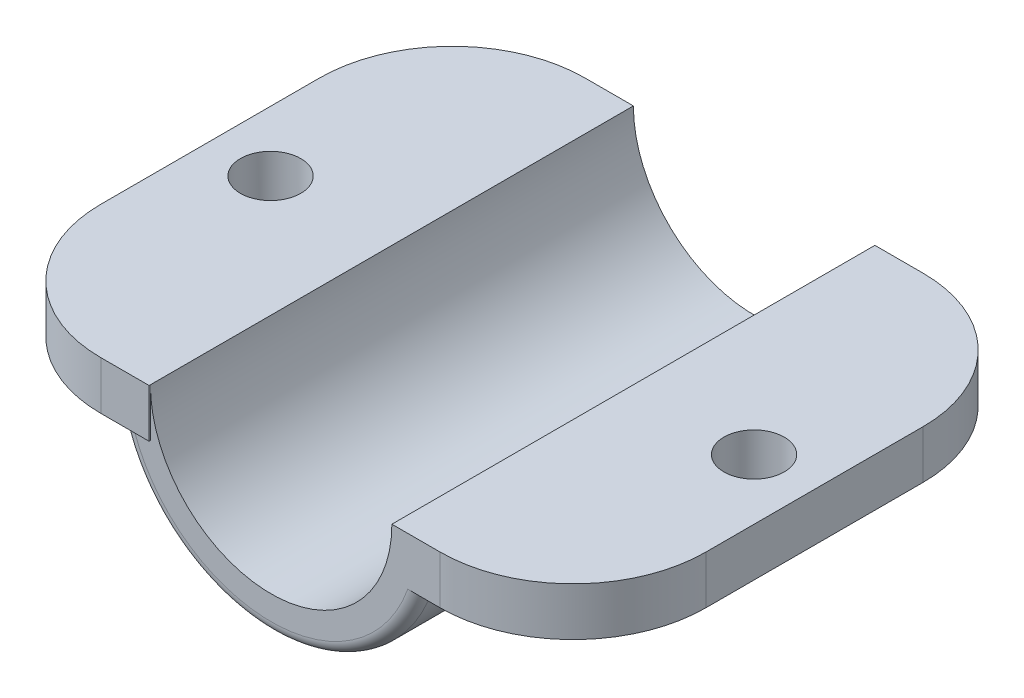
ISO-10303-21;
HEADER;
FILE_DESCRIPTION(('STEP AP214'),'2;1');
FILE_NAME('part.step','',(''),(''),'','','');
FILE_SCHEMA(('AUTOMOTIVE_DESIGN { 1 0 10303 214 1 1 1 1 }'));
ENDSEC;
DATA;
#1=APPLICATION_CONTEXT('core data for automotive mechanical design processes');
#2=APPLICATION_PROTOCOL_DEFINITION('international standard','automotive_design',2000,#1);
#3=PRODUCT_CONTEXT('',#1,'mechanical');
#4=PRODUCT('Part','Part','',(#3));
#5=PRODUCT_RELATED_PRODUCT_CATEGORY('part','',(#4));
#6=PRODUCT_DEFINITION_FORMATION('','',#4);
#7=PRODUCT_DEFINITION_CONTEXT('part definition',#1,'design');
#8=PRODUCT_DEFINITION('design','',#6,#7);
#9=PRODUCT_DEFINITION_SHAPE('','',#8);
#10=(LENGTH_UNIT() NAMED_UNIT(*) SI_UNIT(.MILLI.,.METRE.));
#11=(NAMED_UNIT(*) PLANE_ANGLE_UNIT() SI_UNIT($,.RADIAN.));
#12=(NAMED_UNIT(*) SI_UNIT($,.STERADIAN.) SOLID_ANGLE_UNIT());
#13=UNCERTAINTY_MEASURE_WITH_UNIT(LENGTH_MEASURE(1.E-05),#10,'distance_accuracy_value','');
#14=(GEOMETRIC_REPRESENTATION_CONTEXT(3) GLOBAL_UNCERTAINTY_ASSIGNED_CONTEXT((#13)) GLOBAL_UNIT_ASSIGNED_CONTEXT((#10,
#11,#12)) REPRESENTATION_CONTEXT('',''));
#15=CARTESIAN_POINT('',(0.,0.,0.));
#16=DIRECTION('',(0.,0.,1.));
#17=DIRECTION('',(1.,0.,0.));
#18=AXIS2_PLACEMENT_3D('',#15,#16,#17);
#19=CARTESIAN_POINT('',(0.,-127.,-25.4));
#20=DIRECTION('',(0.,0.,1.));
#21=DIRECTION('',(1.,0.,0.));
#22=AXIS2_PLACEMENT_3D('',#19,#20,#21);
#23=CYLINDRICAL_SURFACE('',#22,16.51);
#24=DIRECTION('',(0.,0.,1.));
#25=VECTOR('',#24,1.);
#26=CARTESIAN_POINT('',(15.7090324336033,-132.08,-25.4));
#27=LINE('',#26,#25);
#28=CARTESIAN_POINT('',(15.7090324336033,-132.08,24.13));
#29=VERTEX_POINT('',#28);
#30=CARTESIAN_POINT('',(15.7090324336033,-132.08,-24.13));
#31=VERTEX_POINT('',#30);
#32=EDGE_CURVE('E168',#29,#31,#27,.F.);
#33=ORIENTED_EDGE('',*,*,#32,.F.);
#34=CARTESIAN_POINT('',(0.,-127.,24.13));
#35=DIRECTION('',(0.,0.,1.));
#36=DIRECTION('',(1.,0.,0.));
#37=AXIS2_PLACEMENT_3D('',#34,#35,#36);
#38=CIRCLE('',#37,16.51);
#39=CARTESIAN_POINT('',(-15.7090324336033,-132.08,24.13));
#40=VERTEX_POINT('',#39);
#41=EDGE_CURVE('E167',#29,#40,#38,.F.);
#42=ORIENTED_EDGE('',*,*,#41,.T.);
#43=DIRECTION('',(0.,0.,1.));
#44=VECTOR('',#43,1.);
#45=CARTESIAN_POINT('',(-15.7090324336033,-132.08,-25.4));
#46=LINE('',#45,#44);
#47=CARTESIAN_POINT('',(-15.7090324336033,-132.08,-24.13));
#48=VERTEX_POINT('',#47);
#49=EDGE_CURVE('E214',#40,#48,#46,.F.);
#50=ORIENTED_EDGE('',*,*,#49,.T.);
#51=CARTESIAN_POINT('',(0.,-127.,-24.13));
#52=DIRECTION('',(0.,0.,1.));
#53=DIRECTION('',(1.,0.,0.));
#54=AXIS2_PLACEMENT_3D('',#51,#52,#53);
#55=CIRCLE('',#54,16.51);
#56=EDGE_CURVE('E180',#48,#31,#55,.T.);
#57=ORIENTED_EDGE('',*,*,#56,.T.);
#58=EDGE_LOOP('',(#33,#42,#50,#57));
#59=FACE_BOUND('',#58,.T.);
#60=ADVANCED_FACE('F35',(#59),#23,.T.);
#61=CARTESIAN_POINT('',(0.,-127.,-24.13));
#62=DIRECTION('',(0.,0.,1.));
#63=DIRECTION('',(1.,0.,0.));
#64=AXIS2_PLACEMENT_3D('',#61,#62,#63);
#65=TOROIDAL_SURFACE('',#64,15.24,1.27);
#66=CARTESIAN_POINT('',(13.329166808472,-132.08,-24.9430825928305));
#67=CARTESIAN_POINT('',(13.2828449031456,-132.08,-24.8911432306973));
#68=CARTESIAN_POINT('',(13.2406826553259,-132.08,-24.835452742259));
#69=CARTESIAN_POINT('',(13.1661230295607,-132.08,-24.7178310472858));
#70=CARTESIAN_POINT('',(13.1337302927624,-132.08,-24.65589689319));
#71=CARTESIAN_POINT('',(13.0799068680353,-132.08,-24.5272742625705));
#72=CARTESIAN_POINT('',(13.0584972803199,-132.08,-24.4605769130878));
#73=CARTESIAN_POINT('',(13.0276407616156,-132.08,-24.3244756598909));
#74=CARTESIAN_POINT('',(13.0181905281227,-132.08,-24.2550725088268));
#75=CARTESIAN_POINT('',(13.0117693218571,-132.08,-24.1180622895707));
#76=CARTESIAN_POINT('',(13.0143852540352,-132.08,-24.0504743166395));
#77=CARTESIAN_POINT('',(13.0310456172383,-132.08,-23.9167290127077));
#78=CARTESIAN_POINT('',(13.0450894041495,-132.08,-23.8505716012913));
#79=CARTESIAN_POINT('',(13.0838607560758,-132.08,-23.7221219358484));
#80=CARTESIAN_POINT('',(13.1084924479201,-132.08,-23.6598006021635));
#81=CARTESIAN_POINT('',(13.1675054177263,-132.08,-23.5399696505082));
#82=CARTESIAN_POINT('',(13.2018879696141,-132.08,-23.4824606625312));
#83=CARTESIAN_POINT('',(13.2806860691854,-132.08,-23.3715441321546));
#84=CARTESIAN_POINT('',(13.3254262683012,-132.08,-23.3183676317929));
#85=CARTESIAN_POINT('',(13.4227201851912,-132.08,-23.2197313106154));
#86=CARTESIAN_POINT('',(13.4752759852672,-132.08,-23.1742735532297));
#87=CARTESIAN_POINT('',(13.590201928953,-132.08,-23.0893547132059));
#88=CARTESIAN_POINT('',(13.6529801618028,-132.08,-23.0504459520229));
#89=CARTESIAN_POINT('',(13.7838958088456,-132.08,-22.9830402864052));
#90=CARTESIAN_POINT('',(13.8520347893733,-132.08,-22.9545464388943));
#91=CARTESIAN_POINT('',(13.9960114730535,-132.08,-22.9071321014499));
#92=CARTESIAN_POINT('',(14.0720663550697,-132.08,-22.8888695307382));
#93=CARTESIAN_POINT('',(14.226139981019,-132.08,-22.864960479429));
#94=CARTESIAN_POINT('',(14.3041591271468,-132.08,-22.8593166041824));
#95=CARTESIAN_POINT('',(14.4623839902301,-132.08,-22.8608371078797));
#96=CARTESIAN_POINT('',(14.5425864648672,-132.08,-22.868383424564));
#97=CARTESIAN_POINT('',(14.7005622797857,-132.08,-22.8969669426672));
#98=CARTESIAN_POINT('',(14.7783355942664,-132.08,-22.9180042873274));
#99=CARTESIAN_POINT('',(14.9283206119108,-132.08,-22.9729283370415));
#100=CARTESIAN_POINT('',(15.0005809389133,-132.08,-23.0066818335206));
#101=CARTESIAN_POINT('',(15.1380655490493,-132.08,-23.0863520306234));
#102=CARTESIAN_POINT('',(15.203291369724,-132.08,-23.1322660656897));
#103=CARTESIAN_POINT('',(15.3218567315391,-132.08,-23.232956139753));
#104=CARTESIAN_POINT('',(15.3755799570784,-132.08,-23.2872799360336));
#105=CARTESIAN_POINT('',(15.4725201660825,-132.08,-23.4046140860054));
#106=CARTESIAN_POINT('',(15.5157406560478,-132.08,-23.4676215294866));
#107=CARTESIAN_POINT('',(15.5880334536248,-132.08,-23.5969338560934));
#108=CARTESIAN_POINT('',(15.6177329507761,-132.08,-23.6628882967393));
#109=CARTESIAN_POINT('',(15.6650917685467,-132.08,-23.7989860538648));
#110=CARTESIAN_POINT('',(15.6827544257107,-132.08,-23.8691282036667));
#111=CARTESIAN_POINT('',(15.704886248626,-132.08,-24.0084835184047));
#112=CARTESIAN_POINT('',(15.7098705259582,-132.08,-24.0776152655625));
#113=CARTESIAN_POINT('',(15.7079645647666,-132.08,-24.2157102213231));
#114=CARTESIAN_POINT('',(15.7010758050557,-132.08,-24.2846734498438));
#115=CARTESIAN_POINT('',(15.6758738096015,-132.08,-24.4193885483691));
#116=CARTESIAN_POINT('',(15.6577351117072,-132.08,-24.485173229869));
#117=CARTESIAN_POINT('',(15.6108254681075,-132.08,-24.6128282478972));
#118=CARTESIAN_POINT('',(15.5820541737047,-132.08,-24.6746984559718));
#119=CARTESIAN_POINT('',(15.5143434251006,-132.08,-24.7937933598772));
#120=CARTESIAN_POINT('',(15.4752613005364,-132.08,-24.8509368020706));
#121=CARTESIAN_POINT('',(15.3883910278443,-132.08,-24.9581611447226));
#122=CARTESIAN_POINT('',(15.3406015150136,-132.08,-25.0082409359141));
#123=CARTESIAN_POINT('',(15.2357411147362,-132.08,-25.1020213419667));
#124=CARTESIAN_POINT('',(15.1783826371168,-132.08,-25.1454001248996));
#125=CARTESIAN_POINT('',(15.057487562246,-132.08,-25.2224546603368));
#126=CARTESIAN_POINT('',(14.9939495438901,-132.08,-25.2561281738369));
#127=CARTESIAN_POINT('',(14.8590854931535,-132.08,-25.3146049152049));
#128=CARTESIAN_POINT('',(14.7875282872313,-132.08,-25.3388750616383));
#129=CARTESIAN_POINT('',(14.6414530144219,-132.08,-25.3756366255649));
#130=CARTESIAN_POINT('',(14.5669343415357,-132.08,-25.3881256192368));
#131=CARTESIAN_POINT('',(14.4134771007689,-132.08,-25.4014626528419));
#132=CARTESIAN_POINT('',(14.3344905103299,-132.08,-25.4017617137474));
#133=CARTESIAN_POINT('',(14.1775120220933,-132.08,-25.3893867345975));
#134=CARTESIAN_POINT('',(14.0995205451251,-132.08,-25.3767073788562));
#135=CARTESIAN_POINT('',(13.9450850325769,-132.08,-25.3382562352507));
#136=CARTESIAN_POINT('',(13.8687078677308,-132.08,-25.3122151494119));
#137=CARTESIAN_POINT('',(13.7215841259,-132.08,-25.2474580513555));
#138=CARTESIAN_POINT('',(13.6508312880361,-132.08,-25.2087563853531));
#139=CARTESIAN_POINT('',(13.5371414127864,-132.08,-25.1328600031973));
#140=CARTESIAN_POINT('',(13.4921914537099,-132.08,-25.0986426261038));
#141=CARTESIAN_POINT('',(13.4069731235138,-132.08,-25.0247983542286));
#142=CARTESIAN_POINT('',(13.3667041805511,-132.08,-24.9851721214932));
#143=CARTESIAN_POINT('',(13.329166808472,-132.08,-24.9430825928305));
#144=B_SPLINE_CURVE_WITH_KNOTS('',3,(#66,#67,#68,#69,#70,#71,#72,#73,#74,#75,#76,#77,#78,#79,
#80,#81,#82,#83,#84,#85,#86,#87,#88,#89,#90,#91,#92,#93,#94,#95,#96,#97,#98,#99,#100,#101,#102,
#103,#104,#105,#106,#107,#108,#109,#110,#111,#112,#113,#114,#115,#116,#117,#118,#119,#120,#121,
#122,#123,#124,#125,#126,#127,#128,#129,#130,#131,#132,#133,#134,#135,#136,#137,#138,#139,#140,
#141,#142,#143),.UNSPECIFIED.,.T.,.F.,(4,2,2,2,2,2,2,2,2,2,2,2,2,2,2,2,2,2,2,2,2,2,2,2,2,2,2,2,
2,2,2,2,2,2,2,2,2,2,4),(0.,0.208595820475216,0.417290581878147,0.62638478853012,
0.835421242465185,1.03735531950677,1.23927801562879,1.43940959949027,1.63956734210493,
1.84714429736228,2.0547766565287,2.27538532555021,2.49605869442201,2.7296476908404,
2.96328491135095,3.20379989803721,3.44431743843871,3.68238249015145,3.92039540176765,
4.14842962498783,4.37638761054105,4.59229377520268,4.80814006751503,5.01506551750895,
5.22196519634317,5.42573255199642,5.62950659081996,5.83626333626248,6.04305251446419,
6.25784350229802,6.47268400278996,6.69836092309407,6.92408426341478,7.15996242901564,
7.39593724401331,7.63686656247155,7.87752381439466,8.04658198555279,8.21561948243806),.UNSPECIFIED.);
#145=CARTESIAN_POINT('',(14.3684097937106,-132.08,-25.4));
#146=VERTEX_POINT('',#145);
#147=EDGE_CURVE('E225',#31,#146,#144,.T.);
#148=ORIENTED_EDGE('',*,*,#147,.F.);
#149=ORIENTED_EDGE('',*,*,#56,.F.);
#150=CARTESIAN_POINT('',(-15.68418246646,-132.08,-24.373912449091));
#151=CARTESIAN_POINT('',(-15.6700894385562,-132.08,-24.4424024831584));
#152=CARTESIAN_POINT('',(-15.65005313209,-132.08,-24.5097319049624));
#153=CARTESIAN_POINT('',(-15.5988085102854,-132.08,-24.6400638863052));
#154=CARTESIAN_POINT('',(-15.5675834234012,-132.08,-24.703059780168));
#155=CARTESIAN_POINT('',(-15.4951335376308,-132.08,-24.8228266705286));
#156=CARTESIAN_POINT('',(-15.4539295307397,-132.08,-24.8796102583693));
#157=CARTESIAN_POINT('',(-15.3628459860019,-132.08,-24.9856827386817));
#158=CARTESIAN_POINT('',(-15.3129682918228,-132.08,-25.0349732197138));
#159=CARTESIAN_POINT('',(-15.2044377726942,-132.08,-25.1263353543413));
#160=CARTESIAN_POINT('',(-15.1455687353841,-132.08,-25.1681498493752));
#161=CARTESIAN_POINT('',(-15.0219218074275,-132.08,-25.2418629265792));
#162=CARTESIAN_POINT('',(-14.957142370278,-132.08,-25.2737589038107));
#163=CARTESIAN_POINT('',(-14.8199979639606,-132.08,-25.3284290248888));
#164=CARTESIAN_POINT('',(-14.7474146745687,-132.08,-25.3506556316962));
#165=CARTESIAN_POINT('',(-14.5996220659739,-132.08,-25.3831758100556));
#166=CARTESIAN_POINT('',(-14.5244121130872,-132.08,-25.3934664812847));
#167=CARTESIAN_POINT('',(-14.3700092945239,-132.08,-25.4021828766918));
#168=CARTESIAN_POINT('',(-14.2907857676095,-132.08,-25.400071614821));
#169=CARTESIAN_POINT('',(-14.1337595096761,-132.08,-25.3828285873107));
#170=CARTESIAN_POINT('',(-14.0559570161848,-132.08,-25.3676946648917));
#171=CARTESIAN_POINT('',(-13.9026052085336,-132.08,-25.3243567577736));
#172=CARTESIAN_POINT('',(-13.827118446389,-132.08,-25.2959304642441));
#173=CARTESIAN_POINT('',(-13.6821340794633,-132.08,-25.2265272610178));
#174=CARTESIAN_POINT('',(-13.6126362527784,-132.08,-25.1855508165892));
#175=CARTESIAN_POINT('',(-13.4834364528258,-132.08,-25.09302134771));
#176=CARTESIAN_POINT('',(-13.4235480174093,-132.08,-25.0417293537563));
#177=CARTESIAN_POINT('',(-13.3138958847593,-132.08,-24.9292586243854));
#178=CARTESIAN_POINT('',(-13.2641284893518,-132.08,-24.8680835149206));
#179=CARTESIAN_POINT('',(-13.1793453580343,-132.08,-24.7413876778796));
#180=CARTESIAN_POINT('',(-13.1436363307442,-132.08,-24.6763313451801));
#181=CARTESIAN_POINT('',(-13.0845329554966,-132.08,-24.540846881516));
#182=CARTESIAN_POINT('',(-13.0611327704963,-132.08,-24.470421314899));
#183=CARTESIAN_POINT('',(-13.0288128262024,-132.08,-24.3311733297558));
#184=CARTESIAN_POINT('',(-13.019047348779,-132.08,-24.2625464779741));
#185=CARTESIAN_POINT('',(-13.0116284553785,-132.08,-24.1246473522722));
#186=CARTESIAN_POINT('',(-13.013972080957,-132.08,-24.0553752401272));
#187=CARTESIAN_POINT('',(-13.0303758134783,-132.08,-23.9206475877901));
#188=CARTESIAN_POINT('',(-13.0440335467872,-132.08,-23.8551424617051));
#189=CARTESIAN_POINT('',(-13.0819979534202,-132.08,-23.727303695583));
#190=CARTESIAN_POINT('',(-13.1063049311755,-132.08,-23.664970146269));
#191=CARTESIAN_POINT('',(-13.1651004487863,-132.08,-23.5441747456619));
#192=CARTESIAN_POINT('',(-13.1997344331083,-132.08,-23.4857838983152));
#193=CARTESIAN_POINT('',(-13.2778461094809,-132.08,-23.3752626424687));
#194=CARTESIAN_POINT('',(-13.321325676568,-132.08,-23.3231335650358));
#195=CARTESIAN_POINT('',(-13.41829962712,-132.08,-23.2236403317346));
#196=CARTESIAN_POINT('',(-13.4722023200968,-132.08,-23.1766744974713));
#197=CARTESIAN_POINT('',(-13.5867170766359,-132.08,-23.0918032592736));
#198=CARTESIAN_POINT('',(-13.6473311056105,-132.08,-23.0539005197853));
#199=CARTESIAN_POINT('',(-13.7777135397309,-132.08,-22.9857087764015));
#200=CARTESIAN_POINT('',(-13.8478198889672,-132.08,-22.9560653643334));
#201=CARTESIAN_POINT('',(-13.991872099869,-132.08,-22.9083681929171));
#202=CARTESIAN_POINT('',(-14.0658189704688,-132.08,-22.8903174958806));
#203=CARTESIAN_POINT('',(-14.2191540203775,-132.08,-22.8655954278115));
#204=CARTESIAN_POINT('',(-14.2986349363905,-132.08,-22.8594957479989));
#205=CARTESIAN_POINT('',(-14.4575166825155,-132.08,-22.8605696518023));
#206=CARTESIAN_POINT('',(-14.5369175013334,-132.08,-22.8677449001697));
#207=CARTESIAN_POINT('',(-14.6942082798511,-132.08,-22.8954568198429));
#208=CARTESIAN_POINT('',(-14.772074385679,-132.08,-22.9161297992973));
#209=CARTESIAN_POINT('',(-14.9230753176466,-132.08,-22.9706219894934));
#210=CARTESIAN_POINT('',(-14.9962106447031,-132.08,-23.0044398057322));
#211=CARTESIAN_POINT('',(-15.1334208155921,-132.08,-23.0833923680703));
#212=CARTESIAN_POINT('',(-15.1976903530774,-132.08,-23.1281881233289));
#213=CARTESIAN_POINT('',(-15.3172806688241,-132.08,-23.2284602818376));
#214=CARTESIAN_POINT('',(-15.3726044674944,-132.08,-23.2839330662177));
#215=CARTESIAN_POINT('',(-15.4697254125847,-132.08,-23.4009976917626));
#216=CARTESIAN_POINT('',(-15.5120634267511,-132.08,-23.4621407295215));
#217=CARTESIAN_POINT('',(-15.5852515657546,-132.08,-23.5909813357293));
#218=CARTESIAN_POINT('',(-15.6161021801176,-132.08,-23.6586786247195));
#219=CARTESIAN_POINT('',(-15.6638819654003,-132.08,-23.7950713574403));
#220=CARTESIAN_POINT('',(-15.6814214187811,-132.08,-23.8635538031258));
#221=CARTESIAN_POINT('',(-15.7043316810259,-132.08,-24.0024565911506));
#222=CARTESIAN_POINT('',(-15.7097217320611,-132.08,-24.0728736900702));
#223=CARTESIAN_POINT('',(-15.7085412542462,-132.08,-24.1819088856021));
#224=CARTESIAN_POINT('',(-15.7062518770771,-132.08,-24.2206196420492));
#225=CARTESIAN_POINT('',(-15.6979775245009,-132.08,-24.2976432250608));
#226=CARTESIAN_POINT('',(-15.6919926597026,-132.08,-24.3359560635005));
#227=CARTESIAN_POINT('',(-15.68418246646,-132.08,-24.373912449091));
#228=B_SPLINE_CURVE_WITH_KNOTS('',3,(#150,#151,#152,#153,#154,#155,#156,#157,#158,#159,#160,
#161,#162,#163,#164,#165,#166,#167,#168,#169,#170,#171,#172,#173,#174,#175,#176,#177,#178,#179,
#180,#181,#182,#183,#184,#185,#186,#187,#188,#189,#190,#191,#192,#193,#194,#195,#196,#197,#198,
#199,#200,#201,#202,#203,#204,#205,#206,#207,#208,#209,#210,#211,#212,#213,#214,#215,#216,#217,
#218,#219,#220,#221,#222,#223,#224,#225,#226,#227),.UNSPECIFIED.,.T.,.F.,(4,2,2,2,2,2,2,2,2,2,2,
2,2,2,2,2,2,2,2,2,2,2,2,2,2,2,2,2,2,2,2,2,2,2,2,2,2,2,4),(0.,0.209626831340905,
0.419569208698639,0.629077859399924,0.838542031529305,1.0542124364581,1.26993943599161,
1.4966573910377,1.72343042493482,1.96009275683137,2.19679429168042,2.43760446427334,
2.67840571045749,2.91374411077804,3.14899636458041,3.37046960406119,3.59183772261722,
3.79875192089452,4.00561556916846,4.20542313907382,4.40523642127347,4.60800866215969,
4.81082393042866,5.02437559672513,5.23798996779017,5.46532811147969,5.69272628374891,
5.93075978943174,6.16882314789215,6.40932859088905,6.64980852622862,6.88363512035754,
7.1173826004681,7.33935932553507,7.56132659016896,7.77237254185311,7.98308400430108,
8.09926024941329,8.21543301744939),.UNSPECIFIED.);
#229=CARTESIAN_POINT('',(-14.3684097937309,-132.08,-25.4));
#230=VERTEX_POINT('',#229);
#231=EDGE_CURVE('E206',#48,#230,#228,.T.);
#232=ORIENTED_EDGE('',*,*,#231,.T.);
#233=CARTESIAN_POINT('',(0.,-127.,-25.4));
#234=DIRECTION('',(0.,0.,1.));
#235=DIRECTION('',(1.,0.,0.));
#236=AXIS2_PLACEMENT_3D('',#233,#234,#235);
#237=CIRCLE('',#236,15.24);
#238=EDGE_CURVE('E176',#146,#230,#237,.F.);
#239=ORIENTED_EDGE('',*,*,#238,.F.);
#240=EDGE_LOOP('',(#148,#149,#232,#239));
#241=FACE_BOUND('',#240,.T.);
#242=ADVANCED_FACE('F217',(#241),#65,.T.);
#243=CARTESIAN_POINT('',(0.,-127.,24.13));
#244=DIRECTION('',(0.,0.,1.));
#245=DIRECTION('',(1.,0.,0.));
#246=AXIS2_PLACEMENT_3D('',#243,#244,#245);
#247=TOROIDAL_SURFACE('',#246,15.24,1.27);
#248=CARTESIAN_POINT('',(13.0666628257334,-132.08,24.4808265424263));
#249=CARTESIAN_POINT('',(13.087515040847,-132.08,24.5484299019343));
#250=CARTESIAN_POINT('',(13.114358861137,-132.08,24.6142572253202));
#251=CARTESIAN_POINT('',(13.1789362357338,-132.08,24.7404141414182));
#252=CARTESIAN_POINT('',(13.2166895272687,-132.08,24.8007335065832));
#253=CARTESIAN_POINT('',(13.3015314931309,-132.08,24.9140954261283));
#254=CARTESIAN_POINT('',(13.3485908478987,-132.08,24.9671599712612));
#255=CARTESIAN_POINT('',(13.4505572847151,-132.08,25.0650548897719));
#256=CARTESIAN_POINT('',(13.5054625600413,-132.08,25.1098871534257));
#257=CARTESIAN_POINT('',(13.6243048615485,-132.08,25.192399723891));
#258=CARTESIAN_POINT('',(13.6885463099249,-132.08,25.2296412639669));
#259=CARTESIAN_POINT('',(13.8221159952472,-132.08,25.2934908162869));
#260=CARTESIAN_POINT('',(13.8914459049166,-132.08,25.3200953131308));
#261=CARTESIAN_POINT('',(14.0374734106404,-132.08,25.3633924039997));
#262=CARTESIAN_POINT('',(14.1143655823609,-132.08,25.3794305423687));
#263=CARTESIAN_POINT('',(14.2697437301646,-132.08,25.3987375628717));
#264=CARTESIAN_POINT('',(14.3482300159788,-132.08,25.4020039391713));
#265=CARTESIAN_POINT('',(14.5067190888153,-132.08,25.3955527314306));
#266=CARTESIAN_POINT('',(14.5867084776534,-132.08,25.3854965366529));
#267=CARTESIAN_POINT('',(14.7438201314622,-132.08,25.351915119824));
#268=CARTESIAN_POINT('',(14.8209424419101,-132.08,25.3283901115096));
#269=CARTESIAN_POINT('',(14.9689175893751,-132.08,25.2687078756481));
#270=CARTESIAN_POINT('',(15.0398419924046,-132.08,25.232728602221));
#271=CARTESIAN_POINT('',(15.1742653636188,-132.08,25.1488503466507));
#272=CARTESIAN_POINT('',(15.2377660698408,-132.08,25.1009541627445));
#273=CARTESIAN_POINT('',(15.352487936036,-132.08,24.9968037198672));
#274=CARTESIAN_POINT('',(15.4041259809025,-132.08,24.9410090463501));
#275=CARTESIAN_POINT('',(15.4966689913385,-132.08,24.821128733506));
#276=CARTESIAN_POINT('',(15.5375775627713,-132.08,24.7570458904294));
#277=CARTESIAN_POINT('',(15.6052359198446,-132.08,24.6260600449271));
#278=CARTESIAN_POINT('',(15.6326180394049,-132.08,24.5594834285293));
#279=CARTESIAN_POINT('',(15.6752954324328,-132.08,24.4225640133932));
#280=CARTESIAN_POINT('',(15.6905939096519,-132.08,24.3522222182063));
#281=CARTESIAN_POINT('',(15.7081598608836,-132.08,24.2127508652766));
#282=CARTESIAN_POINT('',(15.7109164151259,-132.08,24.1436825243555));
#283=CARTESIAN_POINT('',(15.7046335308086,-132.08,24.0060894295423));
#284=CARTESIAN_POINT('',(15.6955953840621,-132.08,23.9375646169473));
#285=CARTESIAN_POINT('',(15.6662395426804,-132.08,23.8038741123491));
#286=CARTESIAN_POINT('',(15.6460626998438,-132.08,23.7386773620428));
#287=CARTESIAN_POINT('',(15.5952298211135,-132.08,23.6125134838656));
#288=CARTESIAN_POINT('',(15.5645732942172,-132.08,23.5515465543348));
#289=CARTESIAN_POINT('',(15.4931790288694,-132.08,23.4343933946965));
#290=CARTESIAN_POINT('',(15.4522767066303,-132.08,23.3783076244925));
#291=CARTESIAN_POINT('',(15.3619746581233,-132.08,23.2734643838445));
#292=CARTESIAN_POINT('',(15.3125735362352,-132.08,23.2247081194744));
#293=CARTESIAN_POINT('',(15.2045841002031,-132.08,23.133773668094));
#294=CARTESIAN_POINT('',(15.1457053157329,-132.08,23.0919406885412));
#295=CARTESIAN_POINT('',(15.0220371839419,-132.08,23.0181967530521));
#296=CARTESIAN_POINT('',(14.9572464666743,-132.08,22.9862881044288));
#297=CARTESIAN_POINT('',(14.8200925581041,-132.08,22.9316029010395));
#298=CARTESIAN_POINT('',(14.7475119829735,-132.08,22.9093714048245));
#299=CARTESIAN_POINT('',(14.5997243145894,-132.08,22.8768410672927));
#300=CARTESIAN_POINT('',(14.5245165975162,-132.08,22.8665450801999));
#301=CARTESIAN_POINT('',(14.3701167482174,-132.08,22.8578172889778));
#302=CARTESIAN_POINT('',(14.2908939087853,-132.08,22.8599225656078));
#303=CARTESIAN_POINT('',(14.1338675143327,-132.08,22.877153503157));
#304=CARTESIAN_POINT('',(14.0560642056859,-132.08,22.8922814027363));
#305=CARTESIAN_POINT('',(13.902709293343,-132.08,22.9356073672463));
#306=CARTESIAN_POINT('',(13.8272202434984,-132.08,22.964027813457));
#307=CARTESIAN_POINT('',(13.6822303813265,-132.08,23.033419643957));
#308=CARTESIAN_POINT('',(13.6127293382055,-132.08,23.0743905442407));
#309=CARTESIAN_POINT('',(13.4835200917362,-132.08,23.1669109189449));
#310=CARTESIAN_POINT('',(13.4236257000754,-132.08,23.218199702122));
#311=CARTESIAN_POINT('',(13.3139636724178,-132.08,23.3306631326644));
#312=CARTESIAN_POINT('',(13.2641919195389,-132.08,23.3918337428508));
#313=CARTESIAN_POINT('',(13.1794039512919,-132.08,23.5185134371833));
#314=CARTESIAN_POINT('',(13.1436932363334,-132.08,23.5835572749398));
#315=CARTESIAN_POINT('',(13.0845744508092,-132.08,23.7190389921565));
#316=CARTESIAN_POINT('',(13.061164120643,-132.08,23.7894758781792));
#317=CARTESIAN_POINT('',(13.0288175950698,-132.08,23.9287759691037));
#318=CARTESIAN_POINT('',(13.019042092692,-132.08,23.9974455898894));
#319=CARTESIAN_POINT('',(13.0116333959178,-132.08,24.1353662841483));
#320=CARTESIAN_POINT('',(13.0139801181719,-132.08,24.204616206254));
#321=CARTESIAN_POINT('',(13.0265872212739,-132.08,24.3082741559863));
#322=CARTESIAN_POINT('',(13.0324510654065,-132.08,24.3432708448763));
#323=CARTESIAN_POINT('',(13.0472624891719,-132.08,24.4126026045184));
#324=CARTESIAN_POINT('',(13.0562098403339,-132.08,24.44693772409));
#325=CARTESIAN_POINT('',(13.0666628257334,-132.08,24.4808265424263));
#326=B_SPLINE_CURVE_WITH_KNOTS('',3,(#248,#249,#250,#251,#252,#253,#254,#255,#256,#257,#258,
#259,#260,#261,#262,#263,#264,#265,#266,#267,#268,#269,#270,#271,#272,#273,#274,#275,#276,#277,
#278,#279,#280,#281,#282,#283,#284,#285,#286,#287,#288,#289,#290,#291,#292,#293,#294,#295,#296,
#297,#298,#299,#300,#301,#302,#303,#304,#305,#306,#307,#308,#309,#310,#311,#312,#313,#314,#315,
#316,#317,#318,#319,#320,#321,#322,#323,#324,#325),.UNSPECIFIED.,.T.,.F.,(4,2,2,2,2,2,2,2,2,2,2,
2,2,2,2,2,2,2,2,2,2,2,2,2,2,2,2,2,2,2,2,2,2,2,2,2,2,2,4),(0.,0.212099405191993,
0.424584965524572,0.636411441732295,0.848189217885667,1.06998736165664,1.29185874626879,
1.52642886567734,1.76104500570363,2.00174011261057,2.2424314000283,2.47981656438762,
2.71714604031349,2.94404995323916,3.17087751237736,3.38575630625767,3.60057810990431,
3.80694669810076,4.01329268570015,4.2170872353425,4.42089133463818,4.62820665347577,
4.835556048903,5.05127989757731,5.26705386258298,5.49376827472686,5.72053689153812,
5.9571967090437,6.19389721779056,6.43470764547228,6.67550878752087,6.9108544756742,
7.14610425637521,7.36754889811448,7.58895284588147,7.7960159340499,8.00273608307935,
8.10906705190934,8.21539014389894),.UNSPECIFIED.);
#327=CARTESIAN_POINT('',(14.3684097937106,-132.08,25.4));
#328=VERTEX_POINT('',#327);
#329=EDGE_CURVE('E149',#328,#29,#326,.T.);
#330=ORIENTED_EDGE('',*,*,#329,.F.);
#331=CARTESIAN_POINT('',(0.,-127.,25.4));
#332=DIRECTION('',(0.,0.,1.));
#333=DIRECTION('',(1.,0.,0.));
#334=AXIS2_PLACEMENT_3D('',#331,#332,#333);
#335=CIRCLE('',#334,15.24);
#336=CARTESIAN_POINT('',(-14.3684097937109,-132.08,25.4000000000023));
#337=VERTEX_POINT('',#336);
#338=EDGE_CURVE('E166',#337,#328,#335,.T.);
#339=ORIENTED_EDGE('',*,*,#338,.F.);
#340=CARTESIAN_POINT('',(-15.68418246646,-132.08,24.373912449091));
#341=CARTESIAN_POINT('',(-15.6979102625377,-132.08,24.3071624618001));
#342=CARTESIAN_POINT('',(-15.7060155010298,-132.08,24.2392078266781));
#343=CARTESIAN_POINT('',(-15.7106557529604,-132.08,24.1028551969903));
#344=CARTESIAN_POINT('',(-15.70717862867,-132.08,24.0344568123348));
#345=CARTESIAN_POINT('',(-15.6887695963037,-132.08,23.8992680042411));
#346=CARTESIAN_POINT('',(-15.6738460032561,-132.08,23.8324764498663));
#347=CARTESIAN_POINT('',(-15.633085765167,-132.08,23.7023342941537));
#348=CARTESIAN_POINT('',(-15.6072509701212,-132.08,23.6389831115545));
#349=CARTESIAN_POINT('',(-15.5452966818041,-132.08,23.5168883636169));
#350=CARTESIAN_POINT('',(-15.5090953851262,-132.08,23.4581863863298));
#351=CARTESIAN_POINT('',(-15.4276717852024,-132.08,23.3474213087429));
#352=CARTESIAN_POINT('',(-15.3824480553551,-132.08,23.2953592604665));
#353=CARTESIAN_POINT('',(-15.2825813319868,-132.08,23.19731734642));
#354=CARTESIAN_POINT('',(-15.2276586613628,-132.08,23.151622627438));
#355=CARTESIAN_POINT('',(-15.1112303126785,-132.08,23.0695859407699));
#356=CARTESIAN_POINT('',(-15.0497231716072,-132.08,23.0332460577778));
#357=CARTESIAN_POINT('',(-14.9186201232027,-132.08,22.9690367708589));
#358=CARTESIAN_POINT('',(-14.8487741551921,-132.08,22.9416779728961));
#359=CARTESIAN_POINT('',(-14.7056077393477,-132.08,22.8984818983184));
#360=CARTESIAN_POINT('',(-14.632286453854,-132.08,22.8826474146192));
#361=CARTESIAN_POINT('',(-14.480572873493,-132.08,22.8622509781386));
#362=CARTESIAN_POINT('',(-14.40210428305,-132.08,22.8582543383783));
#363=CARTESIAN_POINT('',(-14.2455617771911,-132.08,22.8631363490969));
#364=CARTESIAN_POINT('',(-14.1674879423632,-132.08,22.8720175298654));
#365=CARTESIAN_POINT('',(-14.0118964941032,-132.08,22.9028263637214));
#366=CARTESIAN_POINT('',(-13.9344425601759,-132.08,22.9250773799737));
#367=CARTESIAN_POINT('',(-13.7844275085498,-132.08,22.9824231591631));
#368=CARTESIAN_POINT('',(-13.7118665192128,-132.08,23.0175182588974));
#369=CARTESIAN_POINT('',(-13.5748119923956,-132.08,23.0992821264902));
#370=CARTESIAN_POINT('',(-13.510227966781,-132.08,23.1457987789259));
#371=CARTESIAN_POINT('',(-13.3903240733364,-132.08,23.249558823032));
#372=CARTESIAN_POINT('',(-13.3350015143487,-132.08,23.3067990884));
#373=CARTESIAN_POINT('',(-13.2383867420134,-132.08,23.4272793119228));
#374=CARTESIAN_POINT('',(-13.1965160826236,-132.08,23.4900547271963));
#375=CARTESIAN_POINT('',(-13.1248035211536,-132.08,23.6221386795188));
#376=CARTESIAN_POINT('',(-13.0949557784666,-132.08,23.6914440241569));
#377=CARTESIAN_POINT('',(-13.0502086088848,-132.08,23.8295741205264));
#378=CARTESIAN_POINT('',(-13.0344382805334,-132.08,23.8981172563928));
#379=CARTESIAN_POINT('',(-13.0152247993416,-132.08,24.0369048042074));
#380=CARTESIAN_POINT('',(-13.0117777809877,-132.08,24.1071486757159));
#381=CARTESIAN_POINT('',(-13.0172323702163,-132.08,24.2440254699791));
#382=CARTESIAN_POINT('',(-13.0255943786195,-132.08,24.3106806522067));
#383=CARTESIAN_POINT('',(-13.0533631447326,-132.08,24.441640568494));
#384=CARTESIAN_POINT('',(-13.0727695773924,-132.08,24.5059453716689));
#385=CARTESIAN_POINT('',(-13.1219539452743,-132.08,24.6306828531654));
#386=CARTESIAN_POINT('',(-13.1517652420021,-132.08,24.6911023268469));
#387=CARTESIAN_POINT('',(-13.2206794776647,-132.08,24.8063764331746));
#388=CARTESIAN_POINT('',(-13.2597840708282,-132.08,24.8612300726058));
#389=CARTESIAN_POINT('',(-13.3480195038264,-132.08,24.9665566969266));
#390=CARTESIAN_POINT('',(-13.3975286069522,-132.08,25.0167123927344));
#391=CARTESIAN_POINT('',(-13.5038122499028,-132.08,25.1086123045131));
#392=CARTESIAN_POINT('',(-13.5605888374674,-132.08,25.1503541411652));
#393=CARTESIAN_POINT('',(-13.6836922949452,-132.08,25.2270564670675));
#394=CARTESIAN_POINT('',(-13.7503984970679,-132.08,25.2614083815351));
#395=CARTESIAN_POINT('',(-13.8884217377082,-132.08,25.3190780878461));
#396=CARTESIAN_POINT('',(-13.9597400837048,-132.08,25.3423927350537));
#397=CARTESIAN_POINT('',(-14.1090262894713,-132.08,25.3784918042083));
#398=CARTESIAN_POINT('',(-14.1871460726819,-132.08,25.3906502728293));
#399=CARTESIAN_POINT('',(-14.3443295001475,-132.08,25.4019667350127));
#400=CARTESIAN_POINT('',(-14.4233932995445,-132.08,25.401122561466));
#401=CARTESIAN_POINT('',(-14.5818613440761,-132.08,25.3862248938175));
#402=CARTESIAN_POINT('',(-14.661241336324,-132.08,25.371910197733));
#403=CARTESIAN_POINT('',(-14.8163859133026,-132.08,25.3298953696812));
#404=CARTESIAN_POINT('',(-14.8921508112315,-132.08,25.3021963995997));
#405=CARTESIAN_POINT('',(-15.0362398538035,-132.08,25.2346230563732));
#406=CARTESIAN_POINT('',(-15.1046809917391,-132.08,25.1949987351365));
#407=CARTESIAN_POINT('',(-15.2335232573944,-132.08,25.1042749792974));
#408=CARTESIAN_POINT('',(-15.2939243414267,-132.08,25.0531754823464));
#409=CARTESIAN_POINT('',(-15.4018902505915,-132.08,24.9434748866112));
#410=CARTESIAN_POINT('',(-15.4499204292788,-132.08,24.8853315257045));
#411=CARTESIAN_POINT('',(-15.534839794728,-132.08,24.7614855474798));
#412=CARTESIAN_POINT('',(-15.5717475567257,-132.08,24.6957957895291));
#413=CARTESIAN_POINT('',(-15.620562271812,-132.08,24.5867604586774));
#414=CARTESIAN_POINT('',(-15.636533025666,-132.08,24.5451885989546));
#415=CARTESIAN_POINT('',(-15.6638620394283,-132.08,24.4605530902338));
#416=CARTESIAN_POINT('',(-15.6752204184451,-132.08,24.4174894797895));
#417=CARTESIAN_POINT('',(-15.68418246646,-132.08,24.373912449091));
#418=B_SPLINE_CURVE_WITH_KNOTS('',3,(#340,#341,#342,#343,#344,#345,#346,#347,#348,#349,#350,
#351,#352,#353,#354,#355,#356,#357,#358,#359,#360,#361,#362,#363,#364,#365,#366,#367,#368,#369,
#370,#371,#372,#373,#374,#375,#376,#377,#378,#379,#380,#381,#382,#383,#384,#385,#386,#387,#388,
#389,#390,#391,#392,#393,#394,#395,#396,#397,#398,#399,#400,#401,#402,#403,#404,#405,#406,#407,
#408,#409,#410,#411,#412,#413,#414,#415,#416,#417),.UNSPECIFIED.,.T.,.F.,(4,2,2,2,2,2,2,2,2,2,2,
2,2,2,2,2,2,2,2,2,2,2,2,2,2,2,2,2,2,2,2,2,2,2,2,2,2,2,4),(0.,0.204277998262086,
0.408770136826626,0.613113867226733,0.817422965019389,1.02339095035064,1.22939152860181,
1.44278119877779,1.65621838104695,1.88026092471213,2.1043577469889,2.3389963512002,
2.57368106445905,2.81428415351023,3.05489355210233,3.29245745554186,3.52995220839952,
3.75514136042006,3.98022098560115,4.19015133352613,4.40001582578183,4.60059517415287,
4.80116861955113,5.0023911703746,5.20364956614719,5.41415962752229,5.62472913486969,
5.84883744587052,6.07300956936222,6.30910350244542,6.5452367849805,6.78604529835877,
7.0268329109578,7.26288704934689,7.49894247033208,7.72405169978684,7.9487828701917,
8.08214706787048,8.21550782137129),.UNSPECIFIED.);
#419=EDGE_CURVE('E175',#337,#40,#418,.T.);
#420=ORIENTED_EDGE('',*,*,#419,.T.);
#421=ORIENTED_EDGE('',*,*,#41,.F.);
#422=EDGE_LOOP('',(#330,#339,#420,#421));
#423=FACE_BOUND('',#422,.T.);
#424=ADVANCED_FACE('F164',(#423),#247,.T.);
#425=CARTESIAN_POINT('',(0.,-127.,-25.4));
#426=DIRECTION('',(0.,0.,1.));
#427=DIRECTION('',(1.,0.,0.));
#428=AXIS2_PLACEMENT_3D('',#425,#426,#427);
#429=PLANE('',#428);
#430=DIRECTION('',(1.,0.,0.));
#431=VECTOR('',#430,1.);
#432=CARTESIAN_POINT('',(-63.5,-127.,-25.4));
#433=LINE('',#432,#431);
#434=CARTESIAN_POINT('',(12.7,-127.,-25.4));
#435=VERTEX_POINT('',#434);
#436=CARTESIAN_POINT('',(17.78,-127.,-25.4));
#437=VERTEX_POINT('',#436);
#438=EDGE_CURVE('E213',#435,#437,#433,.T.);
#439=ORIENTED_EDGE('',*,*,#438,.T.);
#440=DIRECTION('',(0.,1.,0.));
#441=VECTOR('',#440,1.);
#442=CARTESIAN_POINT('',(17.78,-132.08,-25.4));
#443=LINE('',#442,#441);
#444=CARTESIAN_POINT('',(17.78,-132.08,-25.4));
#445=VERTEX_POINT('',#444);
#446=EDGE_CURVE('E280',#437,#445,#443,.F.);
#447=ORIENTED_EDGE('',*,*,#446,.T.);
#448=DIRECTION('',(-1.,0.,0.));
#449=VECTOR('',#448,1.);
#450=CARTESIAN_POINT('',(31.75,-132.08,-25.4));
#451=LINE('',#450,#449);
#452=EDGE_CURVE('E169',#445,#146,#451,.T.);
#453=ORIENTED_EDGE('',*,*,#452,.T.);
#454=ORIENTED_EDGE('',*,*,#238,.T.);
#455=DIRECTION('',(-1.,0.,0.));
#456=VECTOR('',#455,1.);
#457=CARTESIAN_POINT('',(-31.75,-132.08,-25.4));
#458=LINE('',#457,#456);
#459=CARTESIAN_POINT('',(-17.78,-132.08,-25.4));
#460=VERTEX_POINT('',#459);
#461=EDGE_CURVE('E356',#230,#460,#458,.T.);
#462=ORIENTED_EDGE('',*,*,#461,.T.);
#463=DIRECTION('',(0.,1.,0.));
#464=VECTOR('',#463,1.);
#465=CARTESIAN_POINT('',(-17.78,-127.,-25.4));
#466=LINE('',#465,#464);
#467=CARTESIAN_POINT('',(-17.78,-127.,-25.4));
#468=VERTEX_POINT('',#467);
#469=EDGE_CURVE('E282',#460,#468,#466,.T.);
#470=ORIENTED_EDGE('',*,*,#469,.T.);
#471=CARTESIAN_POINT('',(-12.7,-127.,-25.4));
#472=VERTEX_POINT('',#471);
#473=EDGE_CURVE('E310',#468,#472,#433,.T.);
#474=ORIENTED_EDGE('',*,*,#473,.T.);
#475=CARTESIAN_POINT('',(0.,-127.,-25.4));
#476=DIRECTION('',(0.,0.,1.));
#477=DIRECTION('',(1.,0.,0.));
#478=AXIS2_PLACEMENT_3D('',#475,#476,#477);
#479=CIRCLE('',#478,12.7);
#480=EDGE_CURVE('E314',#472,#435,#479,.T.);
#481=ORIENTED_EDGE('',*,*,#480,.T.);
#482=EDGE_LOOP('',(#439,#447,#453,#454,#462,#470,#474,#481));
#483=FACE_BOUND('',#482,.T.);
#484=ADVANCED_FACE('F328',(#483),#429,.F.);
#485=CARTESIAN_POINT('',(0.,-127.,-25.4));
#486=DIRECTION('',(0.,0.,1.));
#487=DIRECTION('',(1.,0.,0.));
#488=AXIS2_PLACEMENT_3D('',#485,#486,#487);
#489=CYLINDRICAL_SURFACE('',#488,12.7);
#490=CARTESIAN_POINT('',(0.,-127.,25.4));
#491=DIRECTION('',(0.,0.,1.));
#492=DIRECTION('',(1.,0.,0.));
#493=AXIS2_PLACEMENT_3D('',#490,#491,#492);
#494=CIRCLE('',#493,12.7);
#495=CARTESIAN_POINT('',(-12.7,-127.,25.4));
#496=VERTEX_POINT('',#495);
#497=CARTESIAN_POINT('',(12.7,-127.,25.4));
#498=VERTEX_POINT('',#497);
#499=EDGE_CURVE('E307',#496,#498,#494,.T.);
#500=ORIENTED_EDGE('',*,*,#499,.T.);
#501=DIRECTION('',(0.,0.,1.));
#502=VECTOR('',#501,1.);
#503=CARTESIAN_POINT('',(12.7,-127.,-25.4));
#504=LINE('',#503,#502);
#505=EDGE_CURVE('E305',#498,#435,#504,.F.);
#506=ORIENTED_EDGE('',*,*,#505,.T.);
#507=ORIENTED_EDGE('',*,*,#480,.F.);
#508=DIRECTION('',(0.,0.,1.));
#509=VECTOR('',#508,1.);
#510=CARTESIAN_POINT('',(-12.7,-127.,-25.4));
#511=LINE('',#510,#509);
#512=EDGE_CURVE('E306',#472,#496,#511,.T.);
#513=ORIENTED_EDGE('',*,*,#512,.T.);
#514=EDGE_LOOP('',(#500,#506,#507,#513));
#515=FACE_BOUND('',#514,.T.);
#516=ADVANCED_FACE('F338',(#515),#489,.F.);
#517=CARTESIAN_POINT('',(0.,-127.,25.4));
#518=DIRECTION('',(0.,0.,1.));
#519=DIRECTION('',(1.,0.,0.));
#520=AXIS2_PLACEMENT_3D('',#517,#518,#519);
#521=PLANE('',#520);
#522=DIRECTION('',(1.,0.,0.));
#523=VECTOR('',#522,1.);
#524=CARTESIAN_POINT('',(31.75,-132.08,25.4));
#525=LINE('',#524,#523);
#526=CARTESIAN_POINT('',(17.78,-132.08,25.4));
#527=VERTEX_POINT('',#526);
#528=EDGE_CURVE('E145',#328,#527,#525,.T.);
#529=ORIENTED_EDGE('',*,*,#528,.T.);
#530=DIRECTION('',(0.,1.,0.));
#531=VECTOR('',#530,1.);
#532=CARTESIAN_POINT('',(17.78,-127.,25.4));
#533=LINE('',#532,#531);
#534=CARTESIAN_POINT('',(17.78,-127.,25.4));
#535=VERTEX_POINT('',#534);
#536=EDGE_CURVE('E275',#527,#535,#533,.T.);
#537=ORIENTED_EDGE('',*,*,#536,.T.);
#538=DIRECTION('',(1.,0.,0.));
#539=VECTOR('',#538,1.);
#540=CARTESIAN_POINT('',(0.,-127.,25.4));
#541=LINE('',#540,#539);
#542=EDGE_CURVE('E300',#498,#535,#541,.T.);
#543=ORIENTED_EDGE('',*,*,#542,.F.);
#544=ORIENTED_EDGE('',*,*,#499,.F.);
#545=DIRECTION('',(0.,1.,0.));
#546=VECTOR('',#545,1.);
#547=CARTESIAN_POINT('',(-12.7,-127.,25.4));
#548=LINE('',#547,#546);
#549=CARTESIAN_POINT('',(-12.7,-132.08,25.4));
#550=VERTEX_POINT('',#549);
#551=EDGE_CURVE('E339',#550,#496,#548,.T.);
#552=ORIENTED_EDGE('',*,*,#551,.F.);
#553=DIRECTION('',(-1.,0.,0.));
#554=VECTOR('',#553,1.);
#555=CARTESIAN_POINT('',(0.,-132.08,25.4));
#556=LINE('',#555,#554);
#557=EDGE_CURVE('E174',#550,#337,#556,.T.);
#558=ORIENTED_EDGE('',*,*,#557,.T.);
#559=ORIENTED_EDGE('',*,*,#338,.T.);
#560=EDGE_LOOP('',(#529,#537,#543,#544,#552,#558,#559));
#561=FACE_BOUND('',#560,.T.);
#562=ADVANCED_FACE('F172',(#561),#521,.T.);
#563=CARTESIAN_POINT('',(-63.5,-127.,-25.4));
#564=DIRECTION('',(0.,-1.,0.));
#565=DIRECTION('',(0.,0.,-1.));
#566=AXIS2_PLACEMENT_3D('',#563,#564,#565);
#567=PLANE('',#566);
#568=CARTESIAN_POINT('',(-25.4,-127.,0.0600641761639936));
#569=DIRECTION('',(0.,-1.,0.));
#570=DIRECTION('',(0.,0.,-1.));
#571=AXIS2_PLACEMENT_3D('',#568,#569,#570);
#572=CIRCLE('',#571,3.175);
#573=CARTESIAN_POINT('',(-25.4,-127.,-3.114935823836));
#574=VERTEX_POINT('',#573);
#575=EDGE_CURVE('E249',#574,#574,#572,.T.);
#576=ORIENTED_EDGE('',*,*,#575,.T.);
#577=EDGE_LOOP('',(#576));
#578=FACE_BOUND('',#577,.T.);
#579=DIRECTION('',(0.,0.,1.));
#580=VECTOR('',#579,1.);
#581=CARTESIAN_POINT('',(-31.75,-127.,-25.4));
#582=LINE('',#581,#580);
#583=CARTESIAN_POINT('',(-31.75,-127.,-11.43));
#584=VERTEX_POINT('',#583);
#585=CARTESIAN_POINT('',(-31.75,-127.,11.5634759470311));
#586=VERTEX_POINT('',#585);
#587=EDGE_CURVE('E350',#584,#586,#582,.T.);
#588=ORIENTED_EDGE('',*,*,#587,.T.);
#589=CARTESIAN_POINT('',(-17.78,-127.,11.5634759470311));
#590=DIRECTION('',(0.,-1.,0.));
#591=DIRECTION('',(0.,0.,-1.));
#592=AXIS2_PLACEMENT_3D('',#589,#590,#591);
#593=CIRCLE('',#592,13.97);
#594=CARTESIAN_POINT('',(-17.78,-127.,25.5334759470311));
#595=VERTEX_POINT('',#594);
#596=EDGE_CURVE('E60',#586,#595,#593,.F.);
#597=ORIENTED_EDGE('',*,*,#596,.T.);
#598=DIRECTION('',(1.,0.,0.));
#599=VECTOR('',#598,1.);
#600=CARTESIAN_POINT('',(-31.75,-127.,25.5334759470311));
#601=LINE('',#600,#599);
#602=CARTESIAN_POINT('',(-12.7,-127.,25.5334759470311));
#603=VERTEX_POINT('',#602);
#604=EDGE_CURVE('E348',#595,#603,#601,.T.);
#605=ORIENTED_EDGE('',*,*,#604,.T.);
#606=DIRECTION('',(0.,0.,-1.));
#607=VECTOR('',#606,1.);
#608=CARTESIAN_POINT('',(-12.7,-127.,-25.4));
#609=LINE('',#608,#607);
#610=EDGE_CURVE('E232',#603,#496,#609,.T.);
#611=ORIENTED_EDGE('',*,*,#610,.T.);
#612=ORIENTED_EDGE('',*,*,#512,.F.);
#613=ORIENTED_EDGE('',*,*,#473,.F.);
#614=CARTESIAN_POINT('',(-17.78,-127.,-11.43));
#615=DIRECTION('',(0.,-1.,0.));
#616=DIRECTION('',(0.,0.,-1.));
#617=AXIS2_PLACEMENT_3D('',#614,#615,#616);
#618=CIRCLE('',#617,13.97);
#619=EDGE_CURVE('E268',#468,#584,#618,.F.);
#620=ORIENTED_EDGE('',*,*,#619,.T.);
#621=EDGE_LOOP('',(#588,#597,#605,#611,#612,#613,#620));
#622=FACE_BOUND('',#621,.T.);
#623=ADVANCED_FACE('F335',(#578,#622),#567,.F.);
#624=CARTESIAN_POINT('',(25.4,-127.,0.00667379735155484));
#625=DIRECTION('',(0.,-1.,0.));
#626=DIRECTION('',(0.,0.,-1.));
#627=AXIS2_PLACEMENT_3D('',#624,#625,#626);
#628=CIRCLE('',#627,3.175);
#629=CARTESIAN_POINT('',(25.4,-127.,-3.16832620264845));
#630=VERTEX_POINT('',#629);
#631=EDGE_CURVE('E255',#630,#630,#628,.T.);
#632=ORIENTED_EDGE('',*,*,#631,.T.);
#633=EDGE_LOOP('',(#632));
#634=FACE_BOUND('',#633,.T.);
#635=DIRECTION('',(0.,0.,-1.));
#636=VECTOR('',#635,1.);
#637=CARTESIAN_POINT('',(31.75,-127.,-25.4));
#638=LINE('',#637,#636);
#639=CARTESIAN_POINT('',(31.75,-127.,11.43));
#640=VERTEX_POINT('',#639);
#641=CARTESIAN_POINT('',(31.75,-127.,-11.43));
#642=VERTEX_POINT('',#641);
#643=EDGE_CURVE('E159',#640,#642,#638,.T.);
#644=ORIENTED_EDGE('',*,*,#643,.T.);
#645=CARTESIAN_POINT('',(17.78,-127.,-11.43));
#646=DIRECTION('',(0.,-1.,0.));
#647=DIRECTION('',(0.,0.,-1.));
#648=AXIS2_PLACEMENT_3D('',#645,#646,#647);
#649=CIRCLE('',#648,13.97);
#650=EDGE_CURVE('E285',#642,#437,#649,.F.);
#651=ORIENTED_EDGE('',*,*,#650,.T.);
#652=ORIENTED_EDGE('',*,*,#438,.F.);
#653=ORIENTED_EDGE('',*,*,#505,.F.);
#654=ORIENTED_EDGE('',*,*,#542,.T.);
#655=CARTESIAN_POINT('',(17.78,-127.,11.43));
#656=DIRECTION('',(0.,-1.,0.));
#657=DIRECTION('',(0.,0.,-1.));
#658=AXIS2_PLACEMENT_3D('',#655,#656,#657);
#659=CIRCLE('',#658,13.97);
#660=EDGE_CURVE('E287',#535,#640,#659,.F.);
#661=ORIENTED_EDGE('',*,*,#660,.T.);
#662=EDGE_LOOP('',(#644,#651,#652,#653,#654,#661));
#663=FACE_BOUND('',#662,.T.);
#664=ADVANCED_FACE('F303',(#634,#663),#567,.F.);
#665=CARTESIAN_POINT('',(-12.7,-132.08,-25.4));
#666=DIRECTION('',(1.,0.,0.));
#667=DIRECTION('',(0.,0.,-1.));
#668=AXIS2_PLACEMENT_3D('',#665,#666,#667);
#669=PLANE('',#668);
#670=DIRECTION('',(0.,0.,-1.));
#671=VECTOR('',#670,1.);
#672=CARTESIAN_POINT('',(-12.7,-132.08,-25.4));
#673=LINE('',#672,#671);
#674=CARTESIAN_POINT('',(-12.7,-132.08,25.5334759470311));
#675=VERTEX_POINT('',#674);
#676=EDGE_CURVE('E233',#675,#550,#673,.T.);
#677=ORIENTED_EDGE('',*,*,#676,.T.);
#678=ORIENTED_EDGE('',*,*,#551,.T.);
#679=ORIENTED_EDGE('',*,*,#610,.F.);
#680=DIRECTION('',(0.,1.,0.));
#681=VECTOR('',#680,1.);
#682=CARTESIAN_POINT('',(-12.7,-132.08,25.5334759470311));
#683=LINE('',#682,#681);
#684=EDGE_CURVE('E342',#675,#603,#683,.T.);
#685=ORIENTED_EDGE('',*,*,#684,.F.);
#686=EDGE_LOOP('',(#677,#678,#679,#685));
#687=FACE_BOUND('',#686,.T.);
#688=ADVANCED_FACE('F360',(#687),#669,.T.);
#689=CARTESIAN_POINT('',(-31.75,-132.08,25.5334759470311));
#690=DIRECTION('',(0.,0.,1.));
#691=DIRECTION('',(1.,0.,0.));
#692=AXIS2_PLACEMENT_3D('',#689,#690,#691);
#693=PLANE('',#692);
#694=ORIENTED_EDGE('',*,*,#604,.F.);
#695=DIRECTION('',(0.,1.,0.));
#696=VECTOR('',#695,1.);
#697=CARTESIAN_POINT('',(-17.78,-132.08,25.5334759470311));
#698=LINE('',#697,#696);
#699=CARTESIAN_POINT('',(-17.78,-132.08,25.5334759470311));
#700=VERTEX_POINT('',#699);
#701=EDGE_CURVE('E52',#595,#700,#698,.F.);
#702=ORIENTED_EDGE('',*,*,#701,.T.);
#703=DIRECTION('',(1.,0.,0.));
#704=VECTOR('',#703,1.);
#705=CARTESIAN_POINT('',(-31.75,-132.08,25.5334759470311));
#706=LINE('',#705,#704);
#707=EDGE_CURVE('E345',#700,#675,#706,.T.);
#708=ORIENTED_EDGE('',*,*,#707,.T.);
#709=ORIENTED_EDGE('',*,*,#684,.T.);
#710=EDGE_LOOP('',(#694,#702,#708,#709));
#711=FACE_BOUND('',#710,.T.);
#712=ADVANCED_FACE('F202',(#711),#693,.T.);
#713=CARTESIAN_POINT('',(-31.75,-132.08,-25.4));
#714=DIRECTION('',(-1.,0.,0.));
#715=DIRECTION('',(0.,0.,1.));
#716=AXIS2_PLACEMENT_3D('',#713,#714,#715);
#717=PLANE('',#716);
#718=DIRECTION('',(0.,0.,1.));
#719=VECTOR('',#718,1.);
#720=CARTESIAN_POINT('',(-31.75,-132.08,-25.4));
#721=LINE('',#720,#719);
#722=CARTESIAN_POINT('',(-31.75,-132.08,-11.43));
#723=VERTEX_POINT('',#722);
#724=CARTESIAN_POINT('',(-31.75,-132.08,11.5634759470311));
#725=VERTEX_POINT('',#724);
#726=EDGE_CURVE('E354',#723,#725,#721,.T.);
#727=ORIENTED_EDGE('',*,*,#726,.T.);
#728=DIRECTION('',(0.,1.,0.));
#729=VECTOR('',#728,1.);
#730=CARTESIAN_POINT('',(-31.75,-132.08,11.5634759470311));
#731=LINE('',#730,#729);
#732=EDGE_CURVE('E270',#725,#586,#731,.T.);
#733=ORIENTED_EDGE('',*,*,#732,.T.);
#734=ORIENTED_EDGE('',*,*,#587,.F.);
#735=DIRECTION('',(0.,1.,0.));
#736=VECTOR('',#735,1.);
#737=CARTESIAN_POINT('',(-31.75,-132.08,-11.43));
#738=LINE('',#737,#736);
#739=EDGE_CURVE('E273',#584,#723,#738,.F.);
#740=ORIENTED_EDGE('',*,*,#739,.T.);
#741=EDGE_LOOP('',(#727,#733,#734,#740));
#742=FACE_BOUND('',#741,.T.);
#743=ADVANCED_FACE('F199',(#742),#717,.T.);
#744=CARTESIAN_POINT('',(0.,-132.08,0.));
#745=DIRECTION('',(0.,1.,0.));
#746=DIRECTION('',(0.,0.,1.));
#747=AXIS2_PLACEMENT_3D('',#744,#745,#746);
#748=PLANE('',#747);
#749=CARTESIAN_POINT('',(-25.4,-132.08,0.0600641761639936));
#750=DIRECTION('',(0.,1.,0.));
#751=DIRECTION('',(0.,0.,1.));
#752=AXIS2_PLACEMENT_3D('',#749,#750,#751);
#753=CIRCLE('',#752,3.175);
#754=CARTESIAN_POINT('',(-25.4,-132.08,3.23506417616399));
#755=VERTEX_POINT('',#754);
#756=EDGE_CURVE('E39',#755,#755,#753,.T.);
#757=ORIENTED_EDGE('',*,*,#756,.T.);
#758=EDGE_LOOP('',(#757));
#759=FACE_BOUND('',#758,.T.);
#760=ORIENTED_EDGE('',*,*,#707,.F.);
#761=CARTESIAN_POINT('',(-17.78,-132.08,11.5634759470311));
#762=DIRECTION('',(0.,1.,0.));
#763=DIRECTION('',(0.,0.,1.));
#764=AXIS2_PLACEMENT_3D('',#761,#762,#763);
#765=CIRCLE('',#764,13.97);
#766=EDGE_CURVE('E11',#700,#725,#765,.F.);
#767=ORIENTED_EDGE('',*,*,#766,.T.);
#768=ORIENTED_EDGE('',*,*,#726,.F.);
#769=CARTESIAN_POINT('',(-17.78,-132.08,-11.43));
#770=DIRECTION('',(0.,1.,0.));
#771=DIRECTION('',(0.,0.,1.));
#772=AXIS2_PLACEMENT_3D('',#769,#770,#771);
#773=CIRCLE('',#772,13.97);
#774=EDGE_CURVE('E44',#723,#460,#773,.F.);
#775=ORIENTED_EDGE('',*,*,#774,.T.);
#776=ORIENTED_EDGE('',*,*,#461,.F.);
#777=ORIENTED_EDGE('',*,*,#231,.F.);
#778=ORIENTED_EDGE('',*,*,#49,.F.);
#779=ORIENTED_EDGE('',*,*,#419,.F.);
#780=ORIENTED_EDGE('',*,*,#557,.F.);
#781=ORIENTED_EDGE('',*,*,#676,.F.);
#782=EDGE_LOOP('',(#760,#767,#768,#775,#776,#777,#778,#779,#780,#781));
#783=FACE_BOUND('',#782,.T.);
#784=ADVANCED_FACE('F193',(#759,#783),#748,.F.);
#785=CARTESIAN_POINT('',(31.75,-132.08,-25.4));
#786=DIRECTION('',(1.,0.,0.));
#787=DIRECTION('',(0.,0.,-1.));
#788=AXIS2_PLACEMENT_3D('',#785,#786,#787);
#789=PLANE('',#788);
#790=DIRECTION('',(0.,0.,-1.));
#791=VECTOR('',#790,1.);
#792=CARTESIAN_POINT('',(31.75,-132.08,-25.4));
#793=LINE('',#792,#791);
#794=CARTESIAN_POINT('',(31.75,-132.08,11.43));
#795=VERTEX_POINT('',#794);
#796=CARTESIAN_POINT('',(31.75,-132.08,-11.43));
#797=VERTEX_POINT('',#796);
#798=EDGE_CURVE('E158',#795,#797,#793,.T.);
#799=ORIENTED_EDGE('',*,*,#798,.T.);
#800=DIRECTION('',(0.,1.,0.));
#801=VECTOR('',#800,1.);
#802=CARTESIAN_POINT('',(31.75,-127.,-11.43));
#803=LINE('',#802,#801);
#804=EDGE_CURVE('E288',#797,#642,#803,.T.);
#805=ORIENTED_EDGE('',*,*,#804,.T.);
#806=ORIENTED_EDGE('',*,*,#643,.F.);
#807=DIRECTION('',(0.,1.,0.));
#808=VECTOR('',#807,1.);
#809=CARTESIAN_POINT('',(31.75,-132.08,11.43));
#810=LINE('',#809,#808);
#811=EDGE_CURVE('E178',#640,#795,#810,.F.);
#812=ORIENTED_EDGE('',*,*,#811,.T.);
#813=EDGE_LOOP('',(#799,#805,#806,#812));
#814=FACE_BOUND('',#813,.T.);
#815=ADVANCED_FACE('F198',(#814),#789,.T.);
#816=CARTESIAN_POINT('',(0.,-132.08,0.));
#817=DIRECTION('',(0.,-1.,0.));
#818=DIRECTION('',(0.,0.,-1.));
#819=AXIS2_PLACEMENT_3D('',#816,#817,#818);
#820=PLANE('',#819);
#821=CARTESIAN_POINT('',(25.4,-132.08,0.00667379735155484));
#822=DIRECTION('',(0.,-1.,0.));
#823=DIRECTION('',(0.,0.,-1.));
#824=AXIS2_PLACEMENT_3D('',#821,#822,#823);
#825=CIRCLE('',#824,3.175);
#826=CARTESIAN_POINT('',(25.4,-132.08,-3.16832620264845));
#827=VERTEX_POINT('',#826);
#828=EDGE_CURVE('E257',#827,#827,#825,.T.);
#829=ORIENTED_EDGE('',*,*,#828,.F.);
#830=EDGE_LOOP('',(#829));
#831=FACE_BOUND('',#830,.T.);
#832=ORIENTED_EDGE('',*,*,#452,.F.);
#833=CARTESIAN_POINT('',(17.78,-132.08,-11.43));
#834=DIRECTION('',(0.,-1.,0.));
#835=DIRECTION('',(0.,0.,-1.));
#836=AXIS2_PLACEMENT_3D('',#833,#834,#835);
#837=CIRCLE('',#836,13.97);
#838=EDGE_CURVE('E277',#445,#797,#837,.T.);
#839=ORIENTED_EDGE('',*,*,#838,.T.);
#840=ORIENTED_EDGE('',*,*,#798,.F.);
#841=CARTESIAN_POINT('',(17.78,-132.08,11.43));
#842=DIRECTION('',(0.,-1.,0.));
#843=DIRECTION('',(0.,0.,-1.));
#844=AXIS2_PLACEMENT_3D('',#841,#842,#843);
#845=CIRCLE('',#844,13.97);
#846=EDGE_CURVE('E153',#795,#527,#845,.T.);
#847=ORIENTED_EDGE('',*,*,#846,.T.);
#848=ORIENTED_EDGE('',*,*,#528,.F.);
#849=ORIENTED_EDGE('',*,*,#329,.T.);
#850=ORIENTED_EDGE('',*,*,#32,.T.);
#851=ORIENTED_EDGE('',*,*,#147,.T.);
#852=EDGE_LOOP('',(#832,#839,#840,#847,#848,#849,#850,#851));
#853=FACE_BOUND('',#852,.T.);
#854=ADVANCED_FACE('F148',(#831,#853),#820,.T.);
#855=CARTESIAN_POINT('',(17.78,-132.08,-11.43));
#856=DIRECTION('',(0.,-1.,0.));
#857=DIRECTION('',(0.,0.,-1.));
#858=AXIS2_PLACEMENT_3D('',#855,#856,#857);
#859=CYLINDRICAL_SURFACE('',#858,13.97);
#860=ORIENTED_EDGE('',*,*,#838,.F.);
#861=ORIENTED_EDGE('',*,*,#446,.F.);
#862=ORIENTED_EDGE('',*,*,#650,.F.);
#863=ORIENTED_EDGE('',*,*,#804,.F.);
#864=EDGE_LOOP('',(#860,#861,#862,#863));
#865=FACE_BOUND('',#864,.T.);
#866=ADVANCED_FACE('F238',(#865),#859,.T.);
#867=CARTESIAN_POINT('',(17.78,-127.,11.43));
#868=DIRECTION('',(0.,1.,0.));
#869=DIRECTION('',(0.,0.,1.));
#870=AXIS2_PLACEMENT_3D('',#867,#868,#869);
#871=CYLINDRICAL_SURFACE('',#870,13.97);
#872=ORIENTED_EDGE('',*,*,#846,.F.);
#873=ORIENTED_EDGE('',*,*,#811,.F.);
#874=ORIENTED_EDGE('',*,*,#660,.F.);
#875=ORIENTED_EDGE('',*,*,#536,.F.);
#876=EDGE_LOOP('',(#872,#873,#874,#875));
#877=FACE_BOUND('',#876,.T.);
#878=ADVANCED_FACE('F296',(#877),#871,.T.);
#879=CARTESIAN_POINT('',(-17.78,-132.08,11.5634759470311));
#880=DIRECTION('',(0.,1.,0.));
#881=DIRECTION('',(0.,0.,1.));
#882=AXIS2_PLACEMENT_3D('',#879,#880,#881);
#883=CYLINDRICAL_SURFACE('',#882,13.97);
#884=ORIENTED_EDGE('',*,*,#766,.F.);
#885=ORIENTED_EDGE('',*,*,#701,.F.);
#886=ORIENTED_EDGE('',*,*,#596,.F.);
#887=ORIENTED_EDGE('',*,*,#732,.F.);
#888=EDGE_LOOP('',(#884,#885,#886,#887));
#889=FACE_BOUND('',#888,.T.);
#890=ADVANCED_FACE('F371',(#889),#883,.T.);
#891=CARTESIAN_POINT('',(-17.78,-127.,-11.43));
#892=DIRECTION('',(0.,-1.,0.));
#893=DIRECTION('',(0.,0.,-1.));
#894=AXIS2_PLACEMENT_3D('',#891,#892,#893);
#895=CYLINDRICAL_SURFACE('',#894,13.97);
#896=ORIENTED_EDGE('',*,*,#774,.F.);
#897=ORIENTED_EDGE('',*,*,#739,.F.);
#898=ORIENTED_EDGE('',*,*,#619,.F.);
#899=ORIENTED_EDGE('',*,*,#469,.F.);
#900=EDGE_LOOP('',(#896,#897,#898,#899));
#901=FACE_BOUND('',#900,.T.);
#902=ADVANCED_FACE('F37',(#901),#895,.T.);
#903=CARTESIAN_POINT('',(25.4,-143.51,0.00667379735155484));
#904=DIRECTION('',(0.,1.,0.));
#905=DIRECTION('',(0.,0.,1.));
#906=AXIS2_PLACEMENT_3D('',#903,#904,#905);
#907=CYLINDRICAL_SURFACE('',#906,3.175);
#908=ORIENTED_EDGE('',*,*,#828,.T.);
#909=EDGE_LOOP('',(#908));
#910=FACE_BOUND('',#909,.T.);
#911=ORIENTED_EDGE('',*,*,#631,.F.);
#912=EDGE_LOOP('',(#911));
#913=FACE_BOUND('',#912,.T.);
#914=ADVANCED_FACE('F240',(#910,#913),#907,.F.);
#915=CARTESIAN_POINT('',(-25.4,-143.51,0.0600641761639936));
#916=DIRECTION('',(0.,1.,0.));
#917=DIRECTION('',(0.,0.,1.));
#918=AXIS2_PLACEMENT_3D('',#915,#916,#917);
#919=CYLINDRICAL_SURFACE('',#918,3.175);
#920=ORIENTED_EDGE('',*,*,#756,.F.);
#921=EDGE_LOOP('',(#920));
#922=FACE_BOUND('',#921,.T.);
#923=ORIENTED_EDGE('',*,*,#575,.F.);
#924=EDGE_LOOP('',(#923));
#925=FACE_BOUND('',#924,.T.);
#926=ADVANCED_FACE('F505',(#922,#925),#919,.F.);
#927=CLOSED_SHELL('',(#60,#242,#424,#484,#516,#562,#623,#664,#688,#712,#743,#784,#815,#854,#866,
#878,#890,#902,#914,#926));
#928=MANIFOLD_SOLID_BREP('B2',#927);
#929=ADVANCED_BREP_SHAPE_REPRESENTATION('',(#18,#928),#14);
#930=SHAPE_DEFINITION_REPRESENTATION(#9,#929);
ENDSEC;
END-ISO-10303-21;
